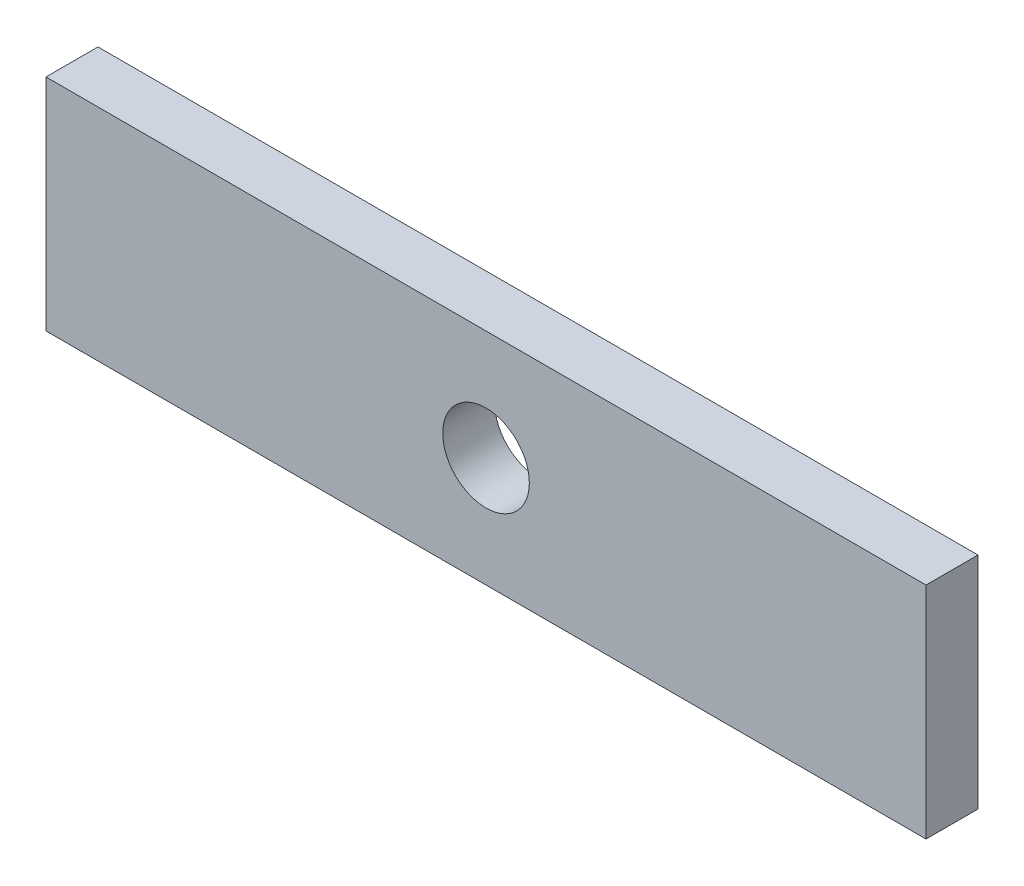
ISO-10303-21;
HEADER;
FILE_DESCRIPTION(('STEP AP214'),'2;1');
FILE_NAME('part.step','',(''),(''),'','','');
FILE_SCHEMA(('AUTOMOTIVE_DESIGN { 1 0 10303 214 1 1 1 1 }'));
ENDSEC;
DATA;
#1=APPLICATION_CONTEXT('core data for automotive mechanical design processes');
#2=APPLICATION_PROTOCOL_DEFINITION('international standard','automotive_design',2000,#1);
#3=PRODUCT_CONTEXT('',#1,'mechanical');
#4=PRODUCT('Part','Part','',(#3));
#5=PRODUCT_RELATED_PRODUCT_CATEGORY('part','',(#4));
#6=PRODUCT_DEFINITION_FORMATION('','',#4);
#7=PRODUCT_DEFINITION_CONTEXT('part definition',#1,'design');
#8=PRODUCT_DEFINITION('design','',#6,#7);
#9=PRODUCT_DEFINITION_SHAPE('','',#8);
#10=(LENGTH_UNIT() NAMED_UNIT(*) SI_UNIT(.MILLI.,.METRE.));
#11=(NAMED_UNIT(*) PLANE_ANGLE_UNIT() SI_UNIT($,.RADIAN.));
#12=(NAMED_UNIT(*) SI_UNIT($,.STERADIAN.) SOLID_ANGLE_UNIT());
#13=UNCERTAINTY_MEASURE_WITH_UNIT(LENGTH_MEASURE(1.E-05),#10,'distance_accuracy_value','');
#14=(GEOMETRIC_REPRESENTATION_CONTEXT(3) GLOBAL_UNCERTAINTY_ASSIGNED_CONTEXT((#13)) GLOBAL_UNIT_ASSIGNED_CONTEXT((#10,
#11,#12)) REPRESENTATION_CONTEXT('',''));
#15=CARTESIAN_POINT('',(0.,0.,0.));
#16=DIRECTION('',(0.,0.,1.));
#17=DIRECTION('',(1.,0.,0.));
#18=AXIS2_PLACEMENT_3D('',#15,#16,#17);
#19=CARTESIAN_POINT('',(0.,0.,3.));
#20=DIRECTION('',(0.,0.,1.));
#21=DIRECTION('',(1.,0.,0.));
#22=AXIS2_PLACEMENT_3D('',#19,#20,#21);
#23=PLANE('',#22);
#24=DIRECTION('',(0.,1.,0.));
#25=VECTOR('',#24,1.);
#26=CARTESIAN_POINT('',(25.4,6.35,3.));
#27=LINE('',#26,#25);
#28=CARTESIAN_POINT('',(25.4,-6.35,3.));
#29=VERTEX_POINT('',#28);
#30=CARTESIAN_POINT('',(25.4,6.35,3.));
#31=VERTEX_POINT('',#30);
#32=EDGE_CURVE('E91',#29,#31,#27,.T.);
#33=ORIENTED_EDGE('',*,*,#32,.T.);
#34=DIRECTION('',(-1.,0.,0.));
#35=VECTOR('',#34,1.);
#36=CARTESIAN_POINT('',(-25.4,6.35,3.));
#37=LINE('',#36,#35);
#38=CARTESIAN_POINT('',(-25.4,6.35,3.));
#39=VERTEX_POINT('',#38);
#40=EDGE_CURVE('E86',#31,#39,#37,.T.);
#41=ORIENTED_EDGE('',*,*,#40,.T.);
#42=DIRECTION('',(0.,-1.,0.));
#43=VECTOR('',#42,1.);
#44=CARTESIAN_POINT('',(-25.4,6.35,3.));
#45=LINE('',#44,#43);
#46=CARTESIAN_POINT('',(-25.4,-6.35,3.));
#47=VERTEX_POINT('',#46);
#48=EDGE_CURVE('E89',#39,#47,#45,.T.);
#49=ORIENTED_EDGE('',*,*,#48,.T.);
#50=DIRECTION('',(1.,0.,0.));
#51=VECTOR('',#50,1.);
#52=CARTESIAN_POINT('',(-25.4,-6.35,3.));
#53=LINE('',#52,#51);
#54=EDGE_CURVE('E56',#47,#29,#53,.T.);
#55=ORIENTED_EDGE('',*,*,#54,.T.);
#56=EDGE_LOOP('',(#33,#41,#49,#55));
#57=FACE_BOUND('',#56,.T.);
#58=CARTESIAN_POINT('',(0.,0.,3.));
#59=DIRECTION('',(0.,0.,1.));
#60=DIRECTION('',(1.,0.,0.));
#61=AXIS2_PLACEMENT_3D('',#58,#59,#60);
#62=CIRCLE('',#61,2.5);
#63=CARTESIAN_POINT('',(2.5,0.,3.));
#64=VERTEX_POINT('',#63);
#65=EDGE_CURVE('E106',#64,#64,#62,.T.);
#66=ORIENTED_EDGE('',*,*,#65,.F.);
#67=EDGE_LOOP('',(#66));
#68=FACE_BOUND('',#67,.T.);
#69=ADVANCED_FACE('F39',(#57,#68),#23,.T.);
#70=CARTESIAN_POINT('',(0.,0.,0.));
#71=DIRECTION('',(0.,0.,1.));
#72=DIRECTION('',(1.,0.,0.));
#73=AXIS2_PLACEMENT_3D('',#70,#71,#72);
#74=PLANE('',#73);
#75=DIRECTION('',(0.,1.,0.));
#76=VECTOR('',#75,1.);
#77=CARTESIAN_POINT('',(25.4,6.35,0.));
#78=LINE('',#77,#76);
#79=CARTESIAN_POINT('',(25.4,-6.35,0.));
#80=VERTEX_POINT('',#79);
#81=CARTESIAN_POINT('',(25.4,6.35,0.));
#82=VERTEX_POINT('',#81);
#83=EDGE_CURVE('E103',#80,#82,#78,.T.);
#84=ORIENTED_EDGE('',*,*,#83,.F.);
#85=DIRECTION('',(1.,0.,0.));
#86=VECTOR('',#85,1.);
#87=CARTESIAN_POINT('',(-25.4,-6.35,0.));
#88=LINE('',#87,#86);
#89=CARTESIAN_POINT('',(-25.4,-6.35,0.));
#90=VERTEX_POINT('',#89);
#91=EDGE_CURVE('E79',#90,#80,#88,.T.);
#92=ORIENTED_EDGE('',*,*,#91,.F.);
#93=DIRECTION('',(0.,-1.,0.));
#94=VECTOR('',#93,1.);
#95=CARTESIAN_POINT('',(-25.4,6.35,0.));
#96=LINE('',#95,#94);
#97=CARTESIAN_POINT('',(-25.4,6.35,0.));
#98=VERTEX_POINT('',#97);
#99=EDGE_CURVE('E73',#98,#90,#96,.T.);
#100=ORIENTED_EDGE('',*,*,#99,.F.);
#101=DIRECTION('',(-1.,0.,0.));
#102=VECTOR('',#101,1.);
#103=CARTESIAN_POINT('',(-25.4,6.35,0.));
#104=LINE('',#103,#102);
#105=EDGE_CURVE('E95',#82,#98,#104,.T.);
#106=ORIENTED_EDGE('',*,*,#105,.F.);
#107=EDGE_LOOP('',(#84,#92,#100,#106));
#108=FACE_BOUND('',#107,.T.);
#109=CARTESIAN_POINT('',(0.,0.,0.));
#110=DIRECTION('',(0.,0.,1.));
#111=DIRECTION('',(1.,0.,0.));
#112=AXIS2_PLACEMENT_3D('',#109,#110,#111);
#113=CIRCLE('',#112,2.5);
#114=CARTESIAN_POINT('',(2.5,0.,0.));
#115=VERTEX_POINT('',#114);
#116=EDGE_CURVE('E118',#115,#115,#113,.T.);
#117=ORIENTED_EDGE('',*,*,#116,.T.);
#118=EDGE_LOOP('',(#117));
#119=FACE_BOUND('',#118,.T.);
#120=ADVANCED_FACE('F114',(#108,#119),#74,.F.);
#121=CARTESIAN_POINT('',(25.4,6.35,3.));
#122=DIRECTION('',(-1.,0.,0.));
#123=DIRECTION('',(0.,-1.,0.));
#124=AXIS2_PLACEMENT_3D('',#121,#122,#123);
#125=PLANE('',#124);
#126=ORIENTED_EDGE('',*,*,#83,.T.);
#127=DIRECTION('',(0.,0.,-1.));
#128=VECTOR('',#127,1.);
#129=CARTESIAN_POINT('',(25.4,6.35,3.));
#130=LINE('',#129,#128);
#131=EDGE_CURVE('E11',#31,#82,#130,.T.);
#132=ORIENTED_EDGE('',*,*,#131,.F.);
#133=ORIENTED_EDGE('',*,*,#32,.F.);
#134=DIRECTION('',(0.,0.,-1.));
#135=VECTOR('',#134,1.);
#136=CARTESIAN_POINT('',(25.4,-6.35,3.));
#137=LINE('',#136,#135);
#138=EDGE_CURVE('E99',#29,#80,#137,.T.);
#139=ORIENTED_EDGE('',*,*,#138,.T.);
#140=EDGE_LOOP('',(#126,#132,#133,#139));
#141=FACE_BOUND('',#140,.T.);
#142=ADVANCED_FACE('F41',(#141),#125,.F.);
#143=CARTESIAN_POINT('',(-25.4,6.35,3.));
#144=DIRECTION('',(0.,-1.,0.));
#145=DIRECTION('',(0.,0.,-1.));
#146=AXIS2_PLACEMENT_3D('',#143,#144,#145);
#147=PLANE('',#146);
#148=ORIENTED_EDGE('',*,*,#105,.T.);
#149=DIRECTION('',(0.,0.,-1.));
#150=VECTOR('',#149,1.);
#151=CARTESIAN_POINT('',(-25.4,6.35,3.));
#152=LINE('',#151,#150);
#153=EDGE_CURVE('E48',#39,#98,#152,.T.);
#154=ORIENTED_EDGE('',*,*,#153,.F.);
#155=ORIENTED_EDGE('',*,*,#40,.F.);
#156=ORIENTED_EDGE('',*,*,#131,.T.);
#157=EDGE_LOOP('',(#148,#154,#155,#156));
#158=FACE_BOUND('',#157,.T.);
#159=ADVANCED_FACE('F94',(#158),#147,.F.);
#160=CARTESIAN_POINT('',(-25.4,6.35,3.));
#161=DIRECTION('',(1.,0.,0.));
#162=DIRECTION('',(0.,1.,0.));
#163=AXIS2_PLACEMENT_3D('',#160,#161,#162);
#164=PLANE('',#163);
#165=ORIENTED_EDGE('',*,*,#99,.T.);
#166=DIRECTION('',(0.,0.,-1.));
#167=VECTOR('',#166,1.);
#168=CARTESIAN_POINT('',(-25.4,-6.35,3.));
#169=LINE('',#168,#167);
#170=EDGE_CURVE('E96',#47,#90,#169,.T.);
#171=ORIENTED_EDGE('',*,*,#170,.F.);
#172=ORIENTED_EDGE('',*,*,#48,.F.);
#173=ORIENTED_EDGE('',*,*,#153,.T.);
#174=EDGE_LOOP('',(#165,#171,#172,#173));
#175=FACE_BOUND('',#174,.T.);
#176=ADVANCED_FACE('F97',(#175),#164,.F.);
#177=CARTESIAN_POINT('',(-25.4,-6.35,3.));
#178=DIRECTION('',(0.,1.,0.));
#179=DIRECTION('',(0.,0.,1.));
#180=AXIS2_PLACEMENT_3D('',#177,#178,#179);
#181=PLANE('',#180);
#182=ORIENTED_EDGE('',*,*,#91,.T.);
#183=ORIENTED_EDGE('',*,*,#138,.F.);
#184=ORIENTED_EDGE('',*,*,#54,.F.);
#185=ORIENTED_EDGE('',*,*,#170,.T.);
#186=EDGE_LOOP('',(#182,#183,#184,#185));
#187=FACE_BOUND('',#186,.T.);
#188=ADVANCED_FACE('F111',(#187),#181,.F.);
#189=CARTESIAN_POINT('',(0.,0.,3.));
#190=DIRECTION('',(0.,0.,-1.));
#191=DIRECTION('',(-1.,0.,0.));
#192=AXIS2_PLACEMENT_3D('',#189,#190,#191);
#193=CYLINDRICAL_SURFACE('',#192,2.5);
#194=ORIENTED_EDGE('',*,*,#65,.T.);
#195=EDGE_LOOP('',(#194));
#196=FACE_BOUND('',#195,.T.);
#197=ORIENTED_EDGE('',*,*,#116,.F.);
#198=EDGE_LOOP('',(#197));
#199=FACE_BOUND('',#198,.T.);
#200=ADVANCED_FACE('F124',(#196,#199),#193,.F.);
#201=CLOSED_SHELL('',(#69,#120,#142,#159,#176,#188,#200));
#202=MANIFOLD_SOLID_BREP('B2',#201);
#203=ADVANCED_BREP_SHAPE_REPRESENTATION('',(#18,#202),#14);
#204=SHAPE_DEFINITION_REPRESENTATION(#9,#203);
ENDSEC;
END-ISO-10303-21;
